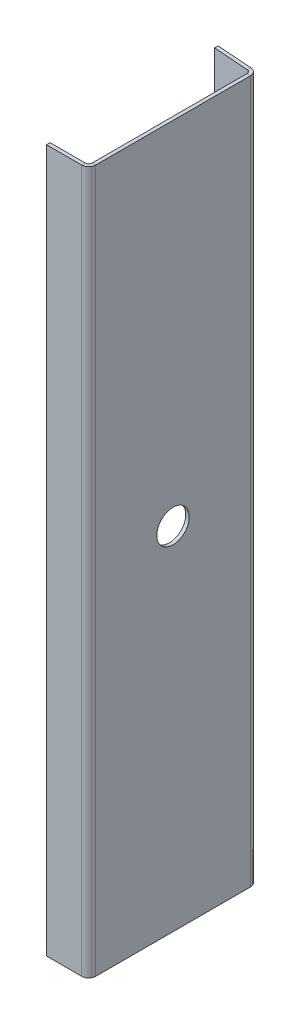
ISO-10303-21;
HEADER;
FILE_DESCRIPTION(('STEP AP214'),'2;1');
FILE_NAME('part.step','',(''),(''),'','','');
FILE_SCHEMA(('AUTOMOTIVE_DESIGN { 1 0 10303 214 1 1 1 1 }'));
ENDSEC;
DATA;
#1=APPLICATION_CONTEXT('core data for automotive mechanical design processes');
#2=APPLICATION_PROTOCOL_DEFINITION('international standard','automotive_design',2000,#1);
#3=PRODUCT_CONTEXT('',#1,'mechanical');
#4=PRODUCT('Part','Part','',(#3));
#5=PRODUCT_RELATED_PRODUCT_CATEGORY('part','',(#4));
#6=PRODUCT_DEFINITION_FORMATION('','',#4);
#7=PRODUCT_DEFINITION_CONTEXT('part definition',#1,'design');
#8=PRODUCT_DEFINITION('design','',#6,#7);
#9=PRODUCT_DEFINITION_SHAPE('','',#8);
#10=(LENGTH_UNIT() NAMED_UNIT(*) SI_UNIT(.MILLI.,.METRE.));
#11=(NAMED_UNIT(*) PLANE_ANGLE_UNIT() SI_UNIT($,.RADIAN.));
#12=(NAMED_UNIT(*) SI_UNIT($,.STERADIAN.) SOLID_ANGLE_UNIT());
#13=UNCERTAINTY_MEASURE_WITH_UNIT(LENGTH_MEASURE(1.E-05),#10,'distance_accuracy_value','');
#14=(GEOMETRIC_REPRESENTATION_CONTEXT(3) GLOBAL_UNCERTAINTY_ASSIGNED_CONTEXT((#13)) GLOBAL_UNIT_ASSIGNED_CONTEXT((#10,
#11,#12)) REPRESENTATION_CONTEXT('',''));
#15=CARTESIAN_POINT('',(0.,0.,0.));
#16=DIRECTION('',(0.,0.,1.));
#17=DIRECTION('',(1.,0.,0.));
#18=AXIS2_PLACEMENT_3D('',#15,#16,#17);
#19=CARTESIAN_POINT('',(0.,1270.,-6.35));
#20=DIRECTION('',(0.,1.,0.));
#21=DIRECTION('',(0.,0.,1.));
#22=AXIS2_PLACEMENT_3D('',#19,#20,#21);
#23=PLANE('',#22);
#24=DIRECTION('',(1.,0.,0.));
#25=VECTOR('',#24,1.);
#26=CARTESIAN_POINT('',(0.,1270.,-6.35));
#27=LINE('',#26,#25);
#28=CARTESIAN_POINT('',(0.,1270.,-6.35));
#29=VERTEX_POINT('',#28);
#30=CARTESIAN_POINT('',(6.35,1270.,-6.35));
#31=VERTEX_POINT('',#30);
#32=EDGE_CURVE('E11',#29,#31,#27,.T.);
#33=ORIENTED_EDGE('',*,*,#32,.F.);
#34=CARTESIAN_POINT('',(-6.35,1270.,-6.35));
#35=DIRECTION('',(0.,-1.,0.));
#36=DIRECTION('',(0.,0.,-1.));
#37=AXIS2_PLACEMENT_3D('',#34,#35,#36);
#38=CIRCLE('',#37,6.35);
#39=CARTESIAN_POINT('',(-6.34999999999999,1270.,0.));
#40=VERTEX_POINT('',#39);
#41=EDGE_CURVE('E249',#40,#29,#38,.F.);
#42=ORIENTED_EDGE('',*,*,#41,.F.);
#43=DIRECTION('',(0.,0.,-1.));
#44=VECTOR('',#43,1.);
#45=CARTESIAN_POINT('',(-6.35,1270.,6.35));
#46=LINE('',#45,#44);
#47=CARTESIAN_POINT('',(-6.35,1270.,6.35));
#48=VERTEX_POINT('',#47);
#49=EDGE_CURVE('E46',#48,#40,#46,.T.);
#50=ORIENTED_EDGE('',*,*,#49,.F.);
#51=CARTESIAN_POINT('',(-6.35,1270.,-6.35));
#52=DIRECTION('',(0.,1.,0.));
#53=DIRECTION('',(1.,0.,0.));
#54=AXIS2_PLACEMENT_3D('',#51,#52,#53);
#55=CIRCLE('',#54,12.7);
#56=EDGE_CURVE('E147',#48,#31,#55,.T.);
#57=ORIENTED_EDGE('',*,*,#56,.T.);
#58=EDGE_LOOP('',(#33,#42,#50,#57));
#59=FACE_BOUND('',#58,.T.);
#60=ADVANCED_FACE('F38',(#59),#23,.T.);
#61=CARTESIAN_POINT('',(-6.35,1270.,6.35));
#62=DIRECTION('',(0.,1.,0.));
#63=DIRECTION('',(0.,0.,1.));
#64=AXIS2_PLACEMENT_3D('',#61,#62,#63);
#65=PLANE('',#64);
#66=DIRECTION('',(0.,0.,-1.));
#67=VECTOR('',#66,1.);
#68=CARTESIAN_POINT('',(0.,1270.,0.));
#69=LINE('',#68,#67);
#70=CARTESIAN_POINT('',(0.,1270.,-286.178529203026));
#71=VERTEX_POINT('',#70);
#72=EDGE_CURVE('E141',#29,#71,#69,.T.);
#73=ORIENTED_EDGE('',*,*,#72,.F.);
#74=ORIENTED_EDGE('',*,*,#32,.T.);
#75=DIRECTION('',(0.,0.,-1.));
#76=VECTOR('',#75,1.);
#77=CARTESIAN_POINT('',(6.35,1270.,0.));
#78=LINE('',#77,#76);
#79=CARTESIAN_POINT('',(6.35,1270.,-286.178529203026));
#80=VERTEX_POINT('',#79);
#81=EDGE_CURVE('E138',#31,#80,#78,.T.);
#82=ORIENTED_EDGE('',*,*,#81,.T.);
#83=DIRECTION('',(-1.,0.,0.));
#84=VECTOR('',#83,1.);
#85=CARTESIAN_POINT('',(6.35,1270.,-286.178529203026));
#86=LINE('',#85,#84);
#87=EDGE_CURVE('E230',#80,#71,#86,.T.);
#88=ORIENTED_EDGE('',*,*,#87,.T.);
#89=EDGE_LOOP('',(#73,#74,#82,#88));
#90=FACE_BOUND('',#89,.T.);
#91=ADVANCED_FACE('F136',(#90),#65,.T.);
#92=CARTESIAN_POINT('',(-6.34999999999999,0.,0.));
#93=DIRECTION('',(0.,-1.,0.));
#94=DIRECTION('',(0.,0.,-1.));
#95=AXIS2_PLACEMENT_3D('',#92,#93,#94);
#96=PLANE('',#95);
#97=DIRECTION('',(0.,0.,1.));
#98=VECTOR('',#97,1.);
#99=CARTESIAN_POINT('',(-6.34999999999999,0.,0.));
#100=LINE('',#99,#98);
#101=CARTESIAN_POINT('',(-6.34999999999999,0.,0.));
#102=VERTEX_POINT('',#101);
#103=CARTESIAN_POINT('',(-6.35,0.,6.35));
#104=VERTEX_POINT('',#103);
#105=EDGE_CURVE('E235',#102,#104,#100,.T.);
#106=ORIENTED_EDGE('',*,*,#105,.F.);
#107=CARTESIAN_POINT('',(-6.35,0.,-6.35));
#108=DIRECTION('',(0.,-1.,0.));
#109=DIRECTION('',(0.,0.,-1.));
#110=AXIS2_PLACEMENT_3D('',#107,#108,#109);
#111=CIRCLE('',#110,6.35);
#112=CARTESIAN_POINT('',(0.,0.,-6.35));
#113=VERTEX_POINT('',#112);
#114=EDGE_CURVE('E187',#102,#113,#111,.F.);
#115=ORIENTED_EDGE('',*,*,#114,.T.);
#116=DIRECTION('',(-1.,0.,0.));
#117=VECTOR('',#116,1.);
#118=CARTESIAN_POINT('',(6.35,0.,-6.35));
#119=LINE('',#118,#117);
#120=CARTESIAN_POINT('',(6.35,0.,-6.35));
#121=VERTEX_POINT('',#120);
#122=EDGE_CURVE('E233',#121,#113,#119,.T.);
#123=ORIENTED_EDGE('',*,*,#122,.F.);
#124=CARTESIAN_POINT('',(-6.35,0.,-6.35));
#125=DIRECTION('',(0.,1.,0.));
#126=DIRECTION('',(1.,0.,0.));
#127=AXIS2_PLACEMENT_3D('',#124,#125,#126);
#128=CIRCLE('',#127,12.7);
#129=EDGE_CURVE('E159',#104,#121,#128,.T.);
#130=ORIENTED_EDGE('',*,*,#129,.F.);
#131=EDGE_LOOP('',(#106,#115,#123,#130));
#132=FACE_BOUND('',#131,.T.);
#133=ADVANCED_FACE('F292',(#132),#96,.T.);
#134=CARTESIAN_POINT('',(6.35,0.,-6.35));
#135=DIRECTION('',(0.,-1.,0.));
#136=DIRECTION('',(0.,0.,-1.));
#137=AXIS2_PLACEMENT_3D('',#134,#135,#136);
#138=PLANE('',#137);
#139=DIRECTION('',(1.,0.,0.));
#140=VECTOR('',#139,1.);
#141=CARTESIAN_POINT('',(-69.85,0.,0.));
#142=LINE('',#141,#140);
#143=CARTESIAN_POINT('',(-69.85,0.,0.));
#144=VERTEX_POINT('',#143);
#145=EDGE_CURVE('E190',#144,#102,#142,.T.);
#146=ORIENTED_EDGE('',*,*,#145,.T.);
#147=ORIENTED_EDGE('',*,*,#105,.T.);
#148=DIRECTION('',(1.,0.,0.));
#149=VECTOR('',#148,1.);
#150=CARTESIAN_POINT('',(-69.85,0.,6.35));
#151=LINE('',#150,#149);
#152=CARTESIAN_POINT('',(-69.85,0.,6.35));
#153=VERTEX_POINT('',#152);
#154=EDGE_CURVE('E196',#153,#104,#151,.T.);
#155=ORIENTED_EDGE('',*,*,#154,.F.);
#156=DIRECTION('',(0.,0.,-1.));
#157=VECTOR('',#156,1.);
#158=CARTESIAN_POINT('',(-69.85,0.,6.35));
#159=LINE('',#158,#157);
#160=EDGE_CURVE('E193',#153,#144,#159,.T.);
#161=ORIENTED_EDGE('',*,*,#160,.T.);
#162=EDGE_LOOP('',(#146,#147,#155,#161));
#163=FACE_BOUND('',#162,.T.);
#164=ADVANCED_FACE('F296',(#163),#138,.T.);
#165=CARTESIAN_POINT('',(-5.90704639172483,1270.,-292.513060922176));
#166=DIRECTION('',(0.,1.,0.));
#167=DIRECTION('',(0.,0.,1.));
#168=AXIS2_PLACEMENT_3D('',#165,#166,#167);
#169=PLANE('',#168);
#170=DIRECTION('',(0.0697564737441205,0.,-0.997564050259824));
#171=VECTOR('',#170,1.);
#172=CARTESIAN_POINT('',(-5.90704639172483,1270.,-292.513060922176));
#173=LINE('',#172,#171);
#174=CARTESIAN_POINT('',(-5.90704639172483,1270.,-292.513060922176));
#175=VERTEX_POINT('',#174);
#176=CARTESIAN_POINT('',(-5.46409278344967,1270.,-298.847592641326));
#177=VERTEX_POINT('',#176);
#178=EDGE_CURVE('E54',#175,#177,#173,.T.);
#179=ORIENTED_EDGE('',*,*,#178,.F.);
#180=CARTESIAN_POINT('',(-6.35,1270.,-286.178529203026));
#181=DIRECTION('',(0.,-1.,0.));
#182=DIRECTION('',(0.,0.,-1.));
#183=AXIS2_PLACEMENT_3D('',#180,#181,#182);
#184=CIRCLE('',#183,6.35);
#185=EDGE_CURVE('E259',#71,#175,#184,.F.);
#186=ORIENTED_EDGE('',*,*,#185,.F.);
#187=ORIENTED_EDGE('',*,*,#87,.F.);
#188=CARTESIAN_POINT('',(-6.35,1270.,-286.178529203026));
#189=DIRECTION('',(0.,1.,0.));
#190=DIRECTION('',(1.,0.,0.));
#191=AXIS2_PLACEMENT_3D('',#188,#189,#190);
#192=CIRCLE('',#191,12.7);
#193=EDGE_CURVE('E167',#80,#177,#192,.T.);
#194=ORIENTED_EDGE('',*,*,#193,.T.);
#195=EDGE_LOOP('',(#179,#186,#187,#194));
#196=FACE_BOUND('',#195,.T.);
#197=ADVANCED_FACE('F302',(#196),#169,.T.);
#198=CARTESIAN_POINT('',(6.35,1270.,-286.178529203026));
#199=DIRECTION('',(0.,1.,0.));
#200=DIRECTION('',(0.,0.,1.));
#201=AXIS2_PLACEMENT_3D('',#198,#199,#200);
#202=PLANE('',#201);
#203=DIRECTION('',(-0.997564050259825,0.,-0.0697564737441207));
#204=VECTOR('',#203,1.);
#205=CARTESIAN_POINT('',(0.,1270.,-292.1));
#206=LINE('',#205,#204);
#207=CARTESIAN_POINT('',(-69.6798489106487,1270.,-296.972489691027));
#208=VERTEX_POINT('',#207);
#209=EDGE_CURVE('E262',#175,#208,#206,.T.);
#210=ORIENTED_EDGE('',*,*,#209,.F.);
#211=ORIENTED_EDGE('',*,*,#178,.T.);
#212=DIRECTION('',(-0.997564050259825,0.,-0.0697564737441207));
#213=VECTOR('',#212,1.);
#214=CARTESIAN_POINT('',(0.442953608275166,1270.,-298.43453171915));
#215=LINE('',#214,#213);
#216=CARTESIAN_POINT('',(-69.2368953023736,1270.,-303.307021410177));
#217=VERTEX_POINT('',#216);
#218=EDGE_CURVE('E108',#177,#217,#215,.T.);
#219=ORIENTED_EDGE('',*,*,#218,.T.);
#220=DIRECTION('',(0.0697564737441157,0.,-0.997564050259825));
#221=VECTOR('',#220,1.);
#222=CARTESIAN_POINT('',(-69.6798489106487,1270.,-296.972489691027));
#223=LINE('',#222,#221);
#224=EDGE_CURVE('E265',#208,#217,#223,.T.);
#225=ORIENTED_EDGE('',*,*,#224,.F.);
#226=EDGE_LOOP('',(#210,#211,#219,#225));
#227=FACE_BOUND('',#226,.T.);
#228=ADVANCED_FACE('F306',(#227),#202,.T.);
#229=CARTESIAN_POINT('',(0.,0.,-286.178529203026));
#230=DIRECTION('',(0.,-1.,0.));
#231=DIRECTION('',(0.,0.,-1.));
#232=AXIS2_PLACEMENT_3D('',#229,#230,#231);
#233=PLANE('',#232);
#234=DIRECTION('',(1.,0.,0.));
#235=VECTOR('',#234,1.);
#236=CARTESIAN_POINT('',(0.,0.,-286.178529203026));
#237=LINE('',#236,#235);
#238=CARTESIAN_POINT('',(0.,0.,-286.178529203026));
#239=VERTEX_POINT('',#238);
#240=CARTESIAN_POINT('',(6.35,0.,-286.178529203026));
#241=VERTEX_POINT('',#240);
#242=EDGE_CURVE('E95',#239,#241,#237,.T.);
#243=ORIENTED_EDGE('',*,*,#242,.F.);
#244=CARTESIAN_POINT('',(-6.35,0.,-286.178529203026));
#245=DIRECTION('',(0.,-1.,0.));
#246=DIRECTION('',(0.,0.,-1.));
#247=AXIS2_PLACEMENT_3D('',#244,#245,#246);
#248=CIRCLE('',#247,6.35);
#249=CARTESIAN_POINT('',(-5.90704639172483,0.,-292.513060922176));
#250=VERTEX_POINT('',#249);
#251=EDGE_CURVE('E183',#239,#250,#248,.F.);
#252=ORIENTED_EDGE('',*,*,#251,.T.);
#253=DIRECTION('',(-0.0697564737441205,0.,0.997564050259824));
#254=VECTOR('',#253,1.);
#255=CARTESIAN_POINT('',(-5.46409278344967,0.,-298.847592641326));
#256=LINE('',#255,#254);
#257=CARTESIAN_POINT('',(-5.46409278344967,0.,-298.847592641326));
#258=VERTEX_POINT('',#257);
#259=EDGE_CURVE('E102',#258,#250,#256,.T.);
#260=ORIENTED_EDGE('',*,*,#259,.F.);
#261=CARTESIAN_POINT('',(-6.35,0.,-286.178529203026));
#262=DIRECTION('',(0.,1.,0.));
#263=DIRECTION('',(1.,0.,0.));
#264=AXIS2_PLACEMENT_3D('',#261,#262,#263);
#265=CIRCLE('',#264,12.7);
#266=EDGE_CURVE('E202',#241,#258,#265,.T.);
#267=ORIENTED_EDGE('',*,*,#266,.F.);
#268=EDGE_LOOP('',(#243,#252,#260,#267));
#269=FACE_BOUND('',#268,.T.);
#270=ADVANCED_FACE('F310',(#269),#233,.T.);
#271=CARTESIAN_POINT('',(-5.46409278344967,0.,-298.847592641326));
#272=DIRECTION('',(0.,-1.,0.));
#273=DIRECTION('',(0.,0.,-1.));
#274=AXIS2_PLACEMENT_3D('',#271,#272,#273);
#275=PLANE('',#274);
#276=DIRECTION('',(0.,0.,-1.));
#277=VECTOR('',#276,1.);
#278=CARTESIAN_POINT('',(0.,0.,0.));
#279=LINE('',#278,#277);
#280=EDGE_CURVE('E185',#113,#239,#279,.T.);
#281=ORIENTED_EDGE('',*,*,#280,.T.);
#282=ORIENTED_EDGE('',*,*,#242,.T.);
#283=DIRECTION('',(0.,0.,-1.));
#284=VECTOR('',#283,1.);
#285=CARTESIAN_POINT('',(6.35,0.,0.));
#286=LINE('',#285,#284);
#287=EDGE_CURVE('E200',#121,#241,#286,.T.);
#288=ORIENTED_EDGE('',*,*,#287,.F.);
#289=ORIENTED_EDGE('',*,*,#122,.T.);
#290=EDGE_LOOP('',(#281,#282,#288,#289));
#291=FACE_BOUND('',#290,.T.);
#292=ADVANCED_FACE('F313',(#291),#275,.T.);
#293=CARTESIAN_POINT('',(0.442953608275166,1270.,-298.43453171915));
#294=DIRECTION('',(-0.0697564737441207,0.,0.997564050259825));
#295=DIRECTION('',(0.997564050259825,0.,0.0697564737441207));
#296=AXIS2_PLACEMENT_3D('',#293,#294,#295);
#297=PLANE('',#296);
#298=DIRECTION('',(-0.997564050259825,0.,-0.0697564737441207));
#299=VECTOR('',#298,1.);
#300=CARTESIAN_POINT('',(0.442953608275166,0.,-298.43453171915));
#301=LINE('',#300,#299);
#302=CARTESIAN_POINT('',(-69.2368953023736,0.,-303.307021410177));
#303=VERTEX_POINT('',#302);
#304=EDGE_CURVE('E173',#258,#303,#301,.T.);
#305=ORIENTED_EDGE('',*,*,#304,.T.);
#306=DIRECTION('',(0.,-1.,0.));
#307=VECTOR('',#306,1.);
#308=CARTESIAN_POINT('',(-69.2368953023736,1270.,-303.307021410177));
#309=LINE('',#308,#307);
#310=EDGE_CURVE('E226',#217,#303,#309,.T.);
#311=ORIENTED_EDGE('',*,*,#310,.F.);
#312=ORIENTED_EDGE('',*,*,#218,.F.);
#313=DIRECTION('',(0.,-1.,0.));
#314=VECTOR('',#313,1.);
#315=CARTESIAN_POINT('',(-5.46409278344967,1270.,-298.847592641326));
#316=LINE('',#315,#314);
#317=EDGE_CURVE('E169',#177,#258,#316,.T.);
#318=ORIENTED_EDGE('',*,*,#317,.T.);
#319=EDGE_LOOP('',(#305,#311,#312,#318));
#320=FACE_BOUND('',#319,.T.);
#321=ADVANCED_FACE('F316',(#320),#297,.F.);
#322=CARTESIAN_POINT('',(-69.6798489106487,1270.,-296.972489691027));
#323=DIRECTION('',(-0.997564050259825,0.,-0.0697564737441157));
#324=DIRECTION('',(-0.0697564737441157,0.,0.997564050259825));
#325=AXIS2_PLACEMENT_3D('',#322,#323,#324);
#326=PLANE('',#325);
#327=DIRECTION('',(0.0697564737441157,0.,-0.997564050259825));
#328=VECTOR('',#327,1.);
#329=CARTESIAN_POINT('',(-69.6798489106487,0.,-296.972489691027));
#330=LINE('',#329,#328);
#331=CARTESIAN_POINT('',(-69.6798489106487,0.,-296.972489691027));
#332=VERTEX_POINT('',#331);
#333=EDGE_CURVE('E176',#332,#303,#330,.T.);
#334=ORIENTED_EDGE('',*,*,#333,.F.);
#335=DIRECTION('',(0.,-1.,0.));
#336=VECTOR('',#335,1.);
#337=CARTESIAN_POINT('',(-69.6798489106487,1270.,-296.972489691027));
#338=LINE('',#337,#336);
#339=EDGE_CURVE('E224',#208,#332,#338,.T.);
#340=ORIENTED_EDGE('',*,*,#339,.F.);
#341=ORIENTED_EDGE('',*,*,#224,.T.);
#342=ORIENTED_EDGE('',*,*,#310,.T.);
#343=EDGE_LOOP('',(#334,#340,#341,#342));
#344=FACE_BOUND('',#343,.T.);
#345=ADVANCED_FACE('F319',(#344),#326,.T.);
#346=CARTESIAN_POINT('',(0.,1270.,-292.1));
#347=DIRECTION('',(-0.0697564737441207,0.,0.997564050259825));
#348=DIRECTION('',(0.997564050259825,0.,0.0697564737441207));
#349=AXIS2_PLACEMENT_3D('',#346,#347,#348);
#350=PLANE('',#349);
#351=DIRECTION('',(-0.997564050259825,0.,-0.0697564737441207));
#352=VECTOR('',#351,1.);
#353=CARTESIAN_POINT('',(0.,0.,-292.1));
#354=LINE('',#353,#352);
#355=EDGE_CURVE('E180',#250,#332,#354,.T.);
#356=ORIENTED_EDGE('',*,*,#355,.F.);
#357=DIRECTION('',(0.,-1.,0.));
#358=VECTOR('',#357,1.);
#359=CARTESIAN_POINT('',(-5.90704639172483,1270.,-292.513060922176));
#360=LINE('',#359,#358);
#361=EDGE_CURVE('E221',#175,#250,#360,.T.);
#362=ORIENTED_EDGE('',*,*,#361,.F.);
#363=ORIENTED_EDGE('',*,*,#209,.T.);
#364=ORIENTED_EDGE('',*,*,#339,.T.);
#365=EDGE_LOOP('',(#356,#362,#363,#364));
#366=FACE_BOUND('',#365,.T.);
#367=ADVANCED_FACE('F323',(#366),#350,.T.);
#368=CARTESIAN_POINT('',(-6.35,1270.,-286.178529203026));
#369=DIRECTION('',(0.,-1.,0.));
#370=DIRECTION('',(0.,0.,-1.));
#371=AXIS2_PLACEMENT_3D('',#368,#369,#370);
#372=CYLINDRICAL_SURFACE('',#371,6.35);
#373=ORIENTED_EDGE('',*,*,#251,.F.);
#374=DIRECTION('',(0.,-1.,0.));
#375=VECTOR('',#374,1.);
#376=CARTESIAN_POINT('',(0.,1270.,-286.178529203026));
#377=LINE('',#376,#375);
#378=EDGE_CURVE('E218',#71,#239,#377,.T.);
#379=ORIENTED_EDGE('',*,*,#378,.F.);
#380=ORIENTED_EDGE('',*,*,#185,.T.);
#381=ORIENTED_EDGE('',*,*,#361,.T.);
#382=EDGE_LOOP('',(#373,#379,#380,#381));
#383=FACE_BOUND('',#382,.T.);
#384=ADVANCED_FACE('F327',(#383),#372,.F.);
#385=CARTESIAN_POINT('',(0.,1270.,0.));
#386=DIRECTION('',(-1.,0.,0.));
#387=DIRECTION('',(0.,0.,1.));
#388=AXIS2_PLACEMENT_3D('',#385,#386,#387);
#389=PLANE('',#388);
#390=CARTESIAN_POINT('',(0.,635.,-146.05));
#391=DIRECTION('',(-1.,0.,0.));
#392=DIRECTION('',(0.,0.,1.));
#393=AXIS2_PLACEMENT_3D('',#390,#391,#392);
#394=CIRCLE('',#393,29.36875);
#395=CARTESIAN_POINT('',(0.,635.,-116.68125));
#396=VERTEX_POINT('',#395);
#397=EDGE_CURVE('E177',#396,#396,#394,.T.);
#398=ORIENTED_EDGE('',*,*,#397,.F.);
#399=EDGE_LOOP('',(#398));
#400=FACE_BOUND('',#399,.T.);
#401=ORIENTED_EDGE('',*,*,#280,.F.);
#402=DIRECTION('',(0.,-1.,0.));
#403=VECTOR('',#402,1.);
#404=CARTESIAN_POINT('',(0.,1270.,-6.35));
#405=LINE('',#404,#403);
#406=EDGE_CURVE('E215',#29,#113,#405,.T.);
#407=ORIENTED_EDGE('',*,*,#406,.F.);
#408=ORIENTED_EDGE('',*,*,#72,.T.);
#409=ORIENTED_EDGE('',*,*,#378,.T.);
#410=EDGE_LOOP('',(#401,#407,#408,#409));
#411=FACE_BOUND('',#410,.T.);
#412=ADVANCED_FACE('F331',(#400,#411),#389,.T.);
#413=CARTESIAN_POINT('',(-6.35,1270.,-6.35));
#414=DIRECTION('',(0.,-1.,0.));
#415=DIRECTION('',(0.,0.,-1.));
#416=AXIS2_PLACEMENT_3D('',#413,#414,#415);
#417=CYLINDRICAL_SURFACE('',#416,6.35);
#418=ORIENTED_EDGE('',*,*,#114,.F.);
#419=DIRECTION('',(0.,-1.,0.));
#420=VECTOR('',#419,1.);
#421=CARTESIAN_POINT('',(-6.34999999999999,1270.,0.));
#422=LINE('',#421,#420);
#423=EDGE_CURVE('E212',#40,#102,#422,.T.);
#424=ORIENTED_EDGE('',*,*,#423,.F.);
#425=ORIENTED_EDGE('',*,*,#41,.T.);
#426=ORIENTED_EDGE('',*,*,#406,.T.);
#427=EDGE_LOOP('',(#418,#424,#425,#426));
#428=FACE_BOUND('',#427,.T.);
#429=ADVANCED_FACE('F248',(#428),#417,.F.);
#430=CARTESIAN_POINT('',(-69.85,1270.,0.));
#431=DIRECTION('',(0.,0.,-1.));
#432=DIRECTION('',(-1.,0.,0.));
#433=AXIS2_PLACEMENT_3D('',#430,#431,#432);
#434=PLANE('',#433);
#435=ORIENTED_EDGE('',*,*,#145,.F.);
#436=DIRECTION('',(0.,-1.,0.));
#437=VECTOR('',#436,1.);
#438=CARTESIAN_POINT('',(-69.85,1270.,0.));
#439=LINE('',#438,#437);
#440=CARTESIAN_POINT('',(-69.85,1270.,0.));
#441=VERTEX_POINT('',#440);
#442=EDGE_CURVE('E210',#441,#144,#439,.T.);
#443=ORIENTED_EDGE('',*,*,#442,.F.);
#444=DIRECTION('',(1.,0.,0.));
#445=VECTOR('',#444,1.);
#446=CARTESIAN_POINT('',(-69.85,1270.,0.));
#447=LINE('',#446,#445);
#448=EDGE_CURVE('E242',#441,#40,#447,.T.);
#449=ORIENTED_EDGE('',*,*,#448,.T.);
#450=ORIENTED_EDGE('',*,*,#423,.T.);
#451=EDGE_LOOP('',(#435,#443,#449,#450));
#452=FACE_BOUND('',#451,.T.);
#453=ADVANCED_FACE('F253',(#452),#434,.T.);
#454=CARTESIAN_POINT('',(-69.85,1270.,6.35));
#455=DIRECTION('',(-1.,0.,0.));
#456=DIRECTION('',(0.,0.,1.));
#457=AXIS2_PLACEMENT_3D('',#454,#455,#456);
#458=PLANE('',#457);
#459=ORIENTED_EDGE('',*,*,#160,.F.);
#460=DIRECTION('',(0.,-1.,0.));
#461=VECTOR('',#460,1.);
#462=CARTESIAN_POINT('',(-69.85,1270.,6.35));
#463=LINE('',#462,#461);
#464=CARTESIAN_POINT('',(-69.85,1270.,6.35));
#465=VERTEX_POINT('',#464);
#466=EDGE_CURVE('E208',#465,#153,#463,.T.);
#467=ORIENTED_EDGE('',*,*,#466,.F.);
#468=DIRECTION('',(0.,0.,-1.));
#469=VECTOR('',#468,1.);
#470=CARTESIAN_POINT('',(-69.85,1270.,6.35));
#471=LINE('',#470,#469);
#472=EDGE_CURVE('E254',#465,#441,#471,.T.);
#473=ORIENTED_EDGE('',*,*,#472,.T.);
#474=ORIENTED_EDGE('',*,*,#442,.T.);
#475=EDGE_LOOP('',(#459,#467,#473,#474));
#476=FACE_BOUND('',#475,.T.);
#477=ADVANCED_FACE('F340',(#476),#458,.T.);
#478=CARTESIAN_POINT('',(-69.85,1270.,6.35));
#479=DIRECTION('',(0.,0.,-1.));
#480=DIRECTION('',(-1.,0.,0.));
#481=AXIS2_PLACEMENT_3D('',#478,#479,#480);
#482=PLANE('',#481);
#483=ORIENTED_EDGE('',*,*,#154,.T.);
#484=DIRECTION('',(0.,-1.,0.));
#485=VECTOR('',#484,1.);
#486=CARTESIAN_POINT('',(-6.35,1270.,6.35));
#487=LINE('',#486,#485);
#488=EDGE_CURVE('E161',#48,#104,#487,.T.);
#489=ORIENTED_EDGE('',*,*,#488,.F.);
#490=DIRECTION('',(1.,0.,0.));
#491=VECTOR('',#490,1.);
#492=CARTESIAN_POINT('',(-69.85,1270.,6.35));
#493=LINE('',#492,#491);
#494=EDGE_CURVE('E152',#465,#48,#493,.T.);
#495=ORIENTED_EDGE('',*,*,#494,.F.);
#496=ORIENTED_EDGE('',*,*,#466,.T.);
#497=EDGE_LOOP('',(#483,#489,#495,#496));
#498=FACE_BOUND('',#497,.T.);
#499=ADVANCED_FACE('F286',(#498),#482,.F.);
#500=CARTESIAN_POINT('',(-6.35,1270.,-6.35));
#501=DIRECTION('',(0.,-1.,0.));
#502=DIRECTION('',(0.,0.,-1.));
#503=AXIS2_PLACEMENT_3D('',#500,#501,#502);
#504=CYLINDRICAL_SURFACE('',#503,12.7);
#505=ORIENTED_EDGE('',*,*,#129,.T.);
#506=DIRECTION('',(0.,-1.,0.));
#507=VECTOR('',#506,1.);
#508=CARTESIAN_POINT('',(6.35,1270.,-6.35));
#509=LINE('',#508,#507);
#510=EDGE_CURVE('E156',#31,#121,#509,.T.);
#511=ORIENTED_EDGE('',*,*,#510,.F.);
#512=ORIENTED_EDGE('',*,*,#56,.F.);
#513=ORIENTED_EDGE('',*,*,#488,.T.);
#514=EDGE_LOOP('',(#505,#511,#512,#513));
#515=FACE_BOUND('',#514,.T.);
#516=ADVANCED_FACE('F157',(#515),#504,.T.);
#517=CARTESIAN_POINT('',(6.35,1270.,0.));
#518=DIRECTION('',(-1.,0.,0.));
#519=DIRECTION('',(0.,0.,1.));
#520=AXIS2_PLACEMENT_3D('',#517,#518,#519);
#521=PLANE('',#520);
#522=CARTESIAN_POINT('',(6.35,635.,-146.05));
#523=DIRECTION('',(1.,0.,0.));
#524=DIRECTION('',(0.,0.,-1.));
#525=AXIS2_PLACEMENT_3D('',#522,#523,#524);
#526=CIRCLE('',#525,29.36875);
#527=CARTESIAN_POINT('',(6.35,635.,-175.41875));
#528=VERTEX_POINT('',#527);
#529=EDGE_CURVE('E271',#528,#528,#526,.T.);
#530=ORIENTED_EDGE('',*,*,#529,.F.);
#531=EDGE_LOOP('',(#530));
#532=FACE_BOUND('',#531,.T.);
#533=ORIENTED_EDGE('',*,*,#287,.T.);
#534=DIRECTION('',(0.,-1.,0.));
#535=VECTOR('',#534,1.);
#536=CARTESIAN_POINT('',(6.35,1270.,-286.178529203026));
#537=LINE('',#536,#535);
#538=EDGE_CURVE('E162',#80,#241,#537,.T.);
#539=ORIENTED_EDGE('',*,*,#538,.F.);
#540=ORIENTED_EDGE('',*,*,#81,.F.);
#541=ORIENTED_EDGE('',*,*,#510,.T.);
#542=EDGE_LOOP('',(#533,#539,#540,#541));
#543=FACE_BOUND('',#542,.T.);
#544=ADVANCED_FACE('F164',(#532,#543),#521,.F.);
#545=CARTESIAN_POINT('',(-6.35,1270.,-286.178529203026));
#546=DIRECTION('',(0.,-1.,0.));
#547=DIRECTION('',(0.,0.,-1.));
#548=AXIS2_PLACEMENT_3D('',#545,#546,#547);
#549=CYLINDRICAL_SURFACE('',#548,12.7);
#550=ORIENTED_EDGE('',*,*,#266,.T.);
#551=ORIENTED_EDGE('',*,*,#317,.F.);
#552=ORIENTED_EDGE('',*,*,#193,.F.);
#553=ORIENTED_EDGE('',*,*,#538,.T.);
#554=EDGE_LOOP('',(#550,#551,#552,#553));
#555=FACE_BOUND('',#554,.T.);
#556=ADVANCED_FACE('F278',(#555),#549,.T.);
#557=CARTESIAN_POINT('',(-6.35,1270.,-286.178529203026));
#558=DIRECTION('',(0.,-1.,0.));
#559=DIRECTION('',(-1.,0.,0.));
#560=AXIS2_PLACEMENT_3D('',#557,#558,#559);
#561=PLANE('',#560);
#562=ORIENTED_EDGE('',*,*,#494,.T.);
#563=ORIENTED_EDGE('',*,*,#49,.T.);
#564=ORIENTED_EDGE('',*,*,#448,.F.);
#565=ORIENTED_EDGE('',*,*,#472,.F.);
#566=EDGE_LOOP('',(#562,#563,#564,#565));
#567=FACE_BOUND('',#566,.T.);
#568=ADVANCED_FACE('F239',(#567),#561,.F.);
#569=CARTESIAN_POINT('',(-6.35,0.,-286.178529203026));
#570=DIRECTION('',(0.,-1.,0.));
#571=DIRECTION('',(-1.,0.,0.));
#572=AXIS2_PLACEMENT_3D('',#569,#570,#571);
#573=PLANE('',#572);
#574=ORIENTED_EDGE('',*,*,#304,.F.);
#575=ORIENTED_EDGE('',*,*,#259,.T.);
#576=ORIENTED_EDGE('',*,*,#355,.T.);
#577=ORIENTED_EDGE('',*,*,#333,.T.);
#578=EDGE_LOOP('',(#574,#575,#576,#577));
#579=FACE_BOUND('',#578,.T.);
#580=ADVANCED_FACE('F360',(#579),#573,.T.);
#581=CARTESIAN_POINT('',(-69.85,635.,-146.05));
#582=DIRECTION('',(1.,0.,0.));
#583=DIRECTION('',(0.,0.,-1.));
#584=AXIS2_PLACEMENT_3D('',#581,#582,#583);
#585=CYLINDRICAL_SURFACE('',#584,29.36875);
#586=ORIENTED_EDGE('',*,*,#397,.T.);
#587=EDGE_LOOP('',(#586));
#588=FACE_BOUND('',#587,.T.);
#589=ORIENTED_EDGE('',*,*,#529,.T.);
#590=EDGE_LOOP('',(#589));
#591=FACE_BOUND('',#590,.T.);
#592=ADVANCED_FACE('F275',(#588,#591),#585,.F.);
#593=CLOSED_SHELL('',(#60,#91,#133,#164,#197,#228,#270,#292,#321,#345,#367,#384,#412,#429,#453,
#477,#499,#516,#544,#556,#568,#580,#592));
#594=MANIFOLD_SOLID_BREP('B2',#593);
#595=ADVANCED_BREP_SHAPE_REPRESENTATION('',(#18,#594),#14);
#596=SHAPE_DEFINITION_REPRESENTATION(#9,#595);
ENDSEC;
END-ISO-10303-21;
